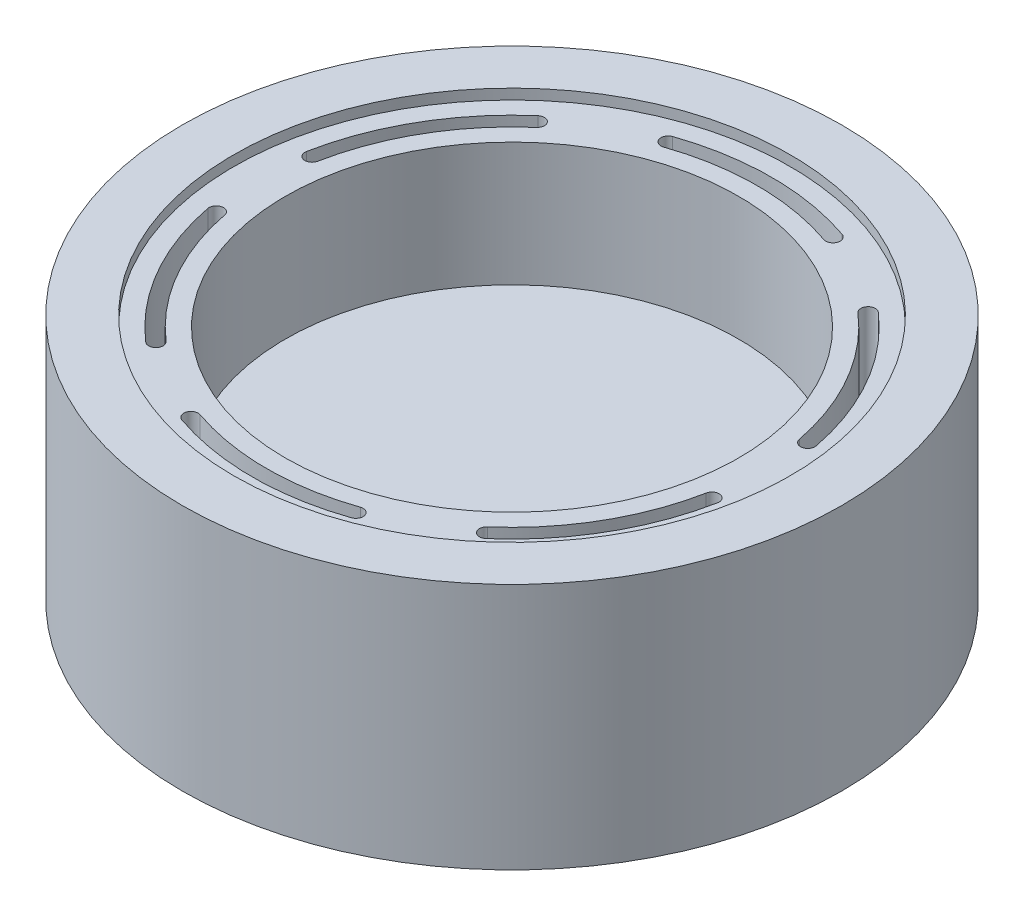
ISO-10303-21;
HEADER;
FILE_DESCRIPTION(('STEP AP214'),'2;1');
FILE_NAME('part.step','',(''),(''),'','','');
FILE_SCHEMA(('AUTOMOTIVE_DESIGN { 1 0 10303 214 1 1 1 1 }'));
ENDSEC;
DATA;
#1=APPLICATION_CONTEXT('core data for automotive mechanical design processes');
#2=APPLICATION_PROTOCOL_DEFINITION('international standard','automotive_design',2000,#1);
#3=PRODUCT_CONTEXT('',#1,'mechanical');
#4=PRODUCT('Part','Part','',(#3));
#5=PRODUCT_RELATED_PRODUCT_CATEGORY('part','',(#4));
#6=PRODUCT_DEFINITION_FORMATION('','',#4);
#7=PRODUCT_DEFINITION_CONTEXT('part definition',#1,'design');
#8=PRODUCT_DEFINITION('design','',#6,#7);
#9=PRODUCT_DEFINITION_SHAPE('','',#8);
#10=(LENGTH_UNIT() NAMED_UNIT(*) SI_UNIT(.MILLI.,.METRE.));
#11=(NAMED_UNIT(*) PLANE_ANGLE_UNIT() SI_UNIT($,.RADIAN.));
#12=(NAMED_UNIT(*) SI_UNIT($,.STERADIAN.) SOLID_ANGLE_UNIT());
#13=UNCERTAINTY_MEASURE_WITH_UNIT(LENGTH_MEASURE(1.E-05),#10,'distance_accuracy_value','');
#14=(GEOMETRIC_REPRESENTATION_CONTEXT(3) GLOBAL_UNCERTAINTY_ASSIGNED_CONTEXT((#13)) GLOBAL_UNIT_ASSIGNED_CONTEXT((#10,
#11,#12)) REPRESENTATION_CONTEXT('',''));
#15=CARTESIAN_POINT('',(0.,0.,0.));
#16=DIRECTION('',(0.,0.,1.));
#17=DIRECTION('',(1.,0.,0.));
#18=AXIS2_PLACEMENT_3D('',#15,#16,#17);
#19=CARTESIAN_POINT('',(335.662294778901,-12.,0.));
#20=DIRECTION('',(0.,1.,0.));
#21=DIRECTION('',(0.,0.,1.));
#22=AXIS2_PLACEMENT_3D('',#19,#20,#21);
#23=PLANE('',#22);
#24=CARTESIAN_POINT('',(347.689601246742,-12.,-2.32516647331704));
#25=DIRECTION('',(0.,1.,0.));
#26=DIRECTION('',(0.,0.,1.));
#27=AXIS2_PLACEMENT_3D('',#24,#25,#26);
#28=CIRCLE('',#27,0.350000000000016);
#29=CARTESIAN_POINT('',(347.345963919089,-12.,-2.25873314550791));
#30=VERTEX_POINT('',#29);
#31=CARTESIAN_POINT('',(348.033238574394,-12.,-2.39159980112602));
#32=VERTEX_POINT('',#31);
#33=EDGE_CURVE('E30',#30,#32,#28,.T.);
#34=ORIENTED_EDGE('',*,*,#33,.F.);
#35=CARTESIAN_POINT('',(335.662294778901,-12.,0.));
#36=DIRECTION('',(0.,-1.,0.));
#37=DIRECTION('',(0.,0.,1.));
#38=AXIS2_PLACEMENT_3D('',#35,#36,#37);
#39=CIRCLE('',#38,11.9);
#40=CARTESIAN_POINT('',(343.460249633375,-12.,-8.9889877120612));
#41=VERTEX_POINT('',#40);
#42=EDGE_CURVE('E193',#41,#30,#39,.T.);
#43=ORIENTED_EDGE('',*,*,#42,.F.);
#44=CARTESIAN_POINT('',(343.689601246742,-12.,-9.25336970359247));
#45=DIRECTION('',(0.,1.,0.));
#46=DIRECTION('',(0.,0.,1.));
#47=AXIS2_PLACEMENT_3D('',#44,#45,#46);
#48=CIRCLE('',#47,0.35000000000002);
#49=CARTESIAN_POINT('',(343.918952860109,-12.,-9.51775169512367));
#50=VERTEX_POINT('',#49);
#51=EDGE_CURVE('E178',#50,#41,#48,.T.);
#52=ORIENTED_EDGE('',*,*,#51,.F.);
#53=CARTESIAN_POINT('',(335.662294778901,-12.,0.));
#54=DIRECTION('',(0.,1.,0.));
#55=DIRECTION('',(0.,0.,1.));
#56=AXIS2_PLACEMENT_3D('',#53,#54,#55);
#57=CIRCLE('',#56,12.6);
#58=EDGE_CURVE('E187',#32,#50,#57,.T.);
#59=ORIENTED_EDGE('',*,*,#58,.F.);
#60=EDGE_LOOP('',(#34,#43,#52,#59));
#61=FACE_BOUND('',#60,.T.);
#62=CARTESIAN_POINT('',(343.689601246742,-12.,9.25336970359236));
#63=DIRECTION('',(0.,1.,0.));
#64=DIRECTION('',(0.,0.,1.));
#65=AXIS2_PLACEMENT_3D('',#62,#63,#64);
#66=CIRCLE('',#65,0.350000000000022);
#67=CARTESIAN_POINT('',(343.460249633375,-12.,8.98898771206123));
#68=VERTEX_POINT('',#67);
#69=CARTESIAN_POINT('',(343.918952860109,-12.,9.51775169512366));
#70=VERTEX_POINT('',#69);
#71=EDGE_CURVE('E200',#68,#70,#66,.T.);
#72=ORIENTED_EDGE('',*,*,#71,.F.);
#73=CARTESIAN_POINT('',(335.662294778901,-12.,0.));
#74=DIRECTION('',(0.,-1.,0.));
#75=DIRECTION('',(0.,0.,1.));
#76=AXIS2_PLACEMENT_3D('',#73,#74,#75);
#77=CIRCLE('',#76,11.9);
#78=CARTESIAN_POINT('',(347.345963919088,-12.,2.25873314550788));
#79=VERTEX_POINT('',#78);
#80=EDGE_CURVE('E210',#79,#68,#77,.T.);
#81=ORIENTED_EDGE('',*,*,#80,.F.);
#82=CARTESIAN_POINT('',(347.689601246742,-12.,2.32516647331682));
#83=DIRECTION('',(0.,1.,0.));
#84=DIRECTION('',(0.,0.,1.));
#85=AXIS2_PLACEMENT_3D('',#82,#83,#84);
#86=CIRCLE('',#85,0.350000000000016);
#87=CARTESIAN_POINT('',(348.033238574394,-12.,2.39159980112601));
#88=VERTEX_POINT('',#87);
#89=EDGE_CURVE('E207',#88,#79,#86,.T.);
#90=ORIENTED_EDGE('',*,*,#89,.F.);
#91=CARTESIAN_POINT('',(335.662294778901,-12.,0.));
#92=DIRECTION('',(0.,1.,0.));
#93=DIRECTION('',(0.,0.,1.));
#94=AXIS2_PLACEMENT_3D('',#91,#92,#93);
#95=CIRCLE('',#94,12.6);
#96=EDGE_CURVE('E204',#70,#88,#95,.T.);
#97=ORIENTED_EDGE('',*,*,#96,.F.);
#98=EDGE_LOOP('',(#72,#81,#90,#97));
#99=FACE_BOUND('',#98,.T.);
#100=CARTESIAN_POINT('',(331.662294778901,-12.,11.5785361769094));
#101=DIRECTION('',(0.,1.,0.));
#102=DIRECTION('',(0.,0.,1.));
#103=AXIS2_PLACEMENT_3D('',#100,#101,#102);
#104=CIRCLE('',#103,0.349999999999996);
#105=CARTESIAN_POINT('',(331.776580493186,-12.,11.2477208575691));
#106=VERTEX_POINT('',#105);
#107=CARTESIAN_POINT('',(331.548009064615,-12.,11.9093514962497));
#108=VERTEX_POINT('',#107);
#109=EDGE_CURVE('E216',#106,#108,#104,.T.);
#110=ORIENTED_EDGE('',*,*,#109,.F.);
#111=CARTESIAN_POINT('',(335.662294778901,-12.,0.));
#112=DIRECTION('',(0.,-1.,0.));
#113=DIRECTION('',(0.,0.,1.));
#114=AXIS2_PLACEMENT_3D('',#111,#112,#113);
#115=CIRCLE('',#114,11.9);
#116=CARTESIAN_POINT('',(339.548009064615,-12.,11.2477208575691));
#117=VERTEX_POINT('',#116);
#118=EDGE_CURVE('E230',#117,#106,#115,.T.);
#119=ORIENTED_EDGE('',*,*,#118,.F.);
#120=CARTESIAN_POINT('',(339.662294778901,-12.,11.5785361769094));
#121=DIRECTION('',(0.,1.,0.));
#122=DIRECTION('',(0.,0.,1.));
#123=AXIS2_PLACEMENT_3D('',#120,#121,#122);
#124=CIRCLE('',#123,0.349999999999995);
#125=CARTESIAN_POINT('',(339.776580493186,-12.,11.9093514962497));
#126=VERTEX_POINT('',#125);
#127=EDGE_CURVE('E227',#126,#117,#124,.T.);
#128=ORIENTED_EDGE('',*,*,#127,.F.);
#129=CARTESIAN_POINT('',(335.662294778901,-12.,0.));
#130=DIRECTION('',(0.,1.,0.));
#131=DIRECTION('',(0.,0.,1.));
#132=AXIS2_PLACEMENT_3D('',#129,#130,#131);
#133=CIRCLE('',#132,12.6);
#134=EDGE_CURVE('E224',#108,#126,#133,.T.);
#135=ORIENTED_EDGE('',*,*,#134,.F.);
#136=EDGE_LOOP('',(#110,#119,#128,#135));
#137=FACE_BOUND('',#136,.T.);
#138=CARTESIAN_POINT('',(323.63498831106,-12.,2.32516647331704));
#139=DIRECTION('',(0.,1.,0.));
#140=DIRECTION('',(0.,0.,1.));
#141=AXIS2_PLACEMENT_3D('',#138,#139,#140);
#142=CIRCLE('',#141,0.350000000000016);
#143=CARTESIAN_POINT('',(323.978625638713,-12.,2.2587331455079));
#144=VERTEX_POINT('',#143);
#145=CARTESIAN_POINT('',(323.291350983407,-12.,2.391599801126));
#146=VERTEX_POINT('',#145);
#147=EDGE_CURVE('E236',#144,#146,#142,.T.);
#148=ORIENTED_EDGE('',*,*,#147,.F.);
#149=CARTESIAN_POINT('',(335.662294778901,-12.,0.));
#150=DIRECTION('',(0.,-1.,0.));
#151=DIRECTION('',(0.,0.,1.));
#152=AXIS2_PLACEMENT_3D('',#149,#150,#151);
#153=CIRCLE('',#152,11.9);
#154=CARTESIAN_POINT('',(327.864339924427,-12.,8.98898771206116));
#155=VERTEX_POINT('',#154);
#156=EDGE_CURVE('E250',#155,#144,#153,.T.);
#157=ORIENTED_EDGE('',*,*,#156,.F.);
#158=CARTESIAN_POINT('',(327.63498831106,-12.,9.25336970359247));
#159=DIRECTION('',(0.,1.,0.));
#160=DIRECTION('',(0.,0.,1.));
#161=AXIS2_PLACEMENT_3D('',#158,#159,#160);
#162=CIRCLE('',#161,0.349999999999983);
#163=CARTESIAN_POINT('',(327.405636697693,-12.,9.51775169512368));
#164=VERTEX_POINT('',#163);
#165=EDGE_CURVE('E247',#164,#155,#162,.T.);
#166=ORIENTED_EDGE('',*,*,#165,.F.);
#167=CARTESIAN_POINT('',(335.662294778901,-12.,0.));
#168=DIRECTION('',(0.,1.,0.));
#169=DIRECTION('',(0.,0.,1.));
#170=AXIS2_PLACEMENT_3D('',#167,#168,#169);
#171=CIRCLE('',#170,12.6);
#172=EDGE_CURVE('E244',#146,#164,#171,.T.);
#173=ORIENTED_EDGE('',*,*,#172,.F.);
#174=EDGE_LOOP('',(#148,#157,#166,#173));
#175=FACE_BOUND('',#174,.T.);
#176=CARTESIAN_POINT('',(327.63498831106,-12.,-9.25336970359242));
#177=DIRECTION('',(0.,1.,0.));
#178=DIRECTION('',(0.,0.,1.));
#179=AXIS2_PLACEMENT_3D('',#176,#177,#178);
#180=CIRCLE('',#179,0.350000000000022);
#181=CARTESIAN_POINT('',(327.864339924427,-12.,-8.98898771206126));
#182=VERTEX_POINT('',#181);
#183=CARTESIAN_POINT('',(327.405636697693,-12.,-9.51775169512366));
#184=VERTEX_POINT('',#183);
#185=EDGE_CURVE('E256',#182,#184,#180,.T.);
#186=ORIENTED_EDGE('',*,*,#185,.F.);
#187=CARTESIAN_POINT('',(335.662294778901,-12.,0.));
#188=DIRECTION('',(0.,-1.,0.));
#189=DIRECTION('',(0.,0.,1.));
#190=AXIS2_PLACEMENT_3D('',#187,#188,#189);
#191=CIRCLE('',#190,11.9);
#192=CARTESIAN_POINT('',(323.978625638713,-12.,-2.25873314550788));
#193=VERTEX_POINT('',#192);
#194=EDGE_CURVE('E270',#193,#182,#191,.T.);
#195=ORIENTED_EDGE('',*,*,#194,.F.);
#196=CARTESIAN_POINT('',(323.63498831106,-12.,-2.32516647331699));
#197=DIRECTION('',(0.,1.,0.));
#198=DIRECTION('',(0.,0.,1.));
#199=AXIS2_PLACEMENT_3D('',#196,#197,#198);
#200=CIRCLE('',#199,0.349999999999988);
#201=CARTESIAN_POINT('',(323.291350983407,-12.,-2.39159980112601));
#202=VERTEX_POINT('',#201);
#203=EDGE_CURVE('E267',#202,#193,#200,.T.);
#204=ORIENTED_EDGE('',*,*,#203,.F.);
#205=CARTESIAN_POINT('',(335.662294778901,-12.,0.));
#206=DIRECTION('',(0.,1.,0.));
#207=DIRECTION('',(0.,0.,1.));
#208=AXIS2_PLACEMENT_3D('',#205,#206,#207);
#209=CIRCLE('',#208,12.6);
#210=EDGE_CURVE('E264',#184,#202,#209,.T.);
#211=ORIENTED_EDGE('',*,*,#210,.F.);
#212=EDGE_LOOP('',(#186,#195,#204,#211));
#213=FACE_BOUND('',#212,.T.);
#214=CARTESIAN_POINT('',(339.662294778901,-12.,-11.5785361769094));
#215=DIRECTION('',(0.,1.,0.));
#216=DIRECTION('',(0.,0.,1.));
#217=AXIS2_PLACEMENT_3D('',#214,#215,#216);
#218=CIRCLE('',#217,0.349999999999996);
#219=CARTESIAN_POINT('',(339.548009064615,-12.,-11.2477208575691));
#220=VERTEX_POINT('',#219);
#221=CARTESIAN_POINT('',(339.776580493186,-12.,-11.9093514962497));
#222=VERTEX_POINT('',#221);
#223=EDGE_CURVE('E276',#220,#222,#218,.T.);
#224=ORIENTED_EDGE('',*,*,#223,.F.);
#225=CARTESIAN_POINT('',(335.662294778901,-12.,0.));
#226=DIRECTION('',(0.,-1.,0.));
#227=DIRECTION('',(0.,0.,1.));
#228=AXIS2_PLACEMENT_3D('',#225,#226,#227);
#229=CIRCLE('',#228,11.9);
#230=CARTESIAN_POINT('',(331.776580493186,-12.,-11.2477208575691));
#231=VERTEX_POINT('',#230);
#232=EDGE_CURVE('E290',#231,#220,#229,.T.);
#233=ORIENTED_EDGE('',*,*,#232,.F.);
#234=CARTESIAN_POINT('',(331.662294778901,-12.,-11.5785361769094));
#235=DIRECTION('',(0.,1.,0.));
#236=DIRECTION('',(0.,0.,1.));
#237=AXIS2_PLACEMENT_3D('',#234,#235,#236);
#238=CIRCLE('',#237,0.349999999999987);
#239=CARTESIAN_POINT('',(331.548009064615,-12.,-11.9093514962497));
#240=VERTEX_POINT('',#239);
#241=EDGE_CURVE('E287',#240,#231,#238,.T.);
#242=ORIENTED_EDGE('',*,*,#241,.F.);
#243=CARTESIAN_POINT('',(335.662294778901,-12.,0.));
#244=DIRECTION('',(0.,1.,0.));
#245=DIRECTION('',(0.,0.,1.));
#246=AXIS2_PLACEMENT_3D('',#243,#244,#245);
#247=CIRCLE('',#246,12.6);
#248=EDGE_CURVE('E284',#222,#240,#247,.T.);
#249=ORIENTED_EDGE('',*,*,#248,.F.);
#250=EDGE_LOOP('',(#224,#233,#242,#249));
#251=FACE_BOUND('',#250,.T.);
#252=CARTESIAN_POINT('',(335.662294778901,-12.,0.));
#253=DIRECTION('',(0.,1.,0.));
#254=DIRECTION('',(0.,0.,1.));
#255=AXIS2_PLACEMENT_3D('',#252,#253,#254);
#256=CIRCLE('',#255,11.);
#257=CARTESIAN_POINT('',(335.662294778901,-12.,11.));
#258=VERTEX_POINT('',#257);
#259=EDGE_CURVE('E306',#258,#258,#256,.T.);
#260=ORIENTED_EDGE('',*,*,#259,.F.);
#261=EDGE_LOOP('',(#260));
#262=FACE_BOUND('',#261,.T.);
#263=CARTESIAN_POINT('',(335.662294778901,-12.,0.));
#264=DIRECTION('',(0.,1.,0.));
#265=DIRECTION('',(0.,0.,1.));
#266=AXIS2_PLACEMENT_3D('',#263,#264,#265);
#267=CIRCLE('',#266,13.5);
#268=CARTESIAN_POINT('',(335.662294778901,-12.,13.5));
#269=VERTEX_POINT('',#268);
#270=EDGE_CURVE('E312',#269,#269,#267,.T.);
#271=ORIENTED_EDGE('',*,*,#270,.T.);
#272=EDGE_LOOP('',(#271));
#273=FACE_BOUND('',#272,.T.);
#274=ADVANCED_FACE('F16',(#61,#99,#137,#175,#213,#251,#262,#273),#23,.T.);
#275=CARTESIAN_POINT('',(319.662294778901,-23.5,0.));
#276=DIRECTION('',(0.,-1.,0.));
#277=DIRECTION('',(0.,0.,-1.));
#278=AXIS2_PLACEMENT_3D('',#275,#276,#277);
#279=PLANE('',#278);
#280=CARTESIAN_POINT('',(335.662294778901,-23.5,0.));
#281=DIRECTION('',(0.,-1.,0.));
#282=DIRECTION('',(0.,0.,-1.));
#283=AXIS2_PLACEMENT_3D('',#280,#281,#282);
#284=CIRCLE('',#283,14.5);
#285=CARTESIAN_POINT('',(335.662294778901,-23.5,-14.5));
#286=VERTEX_POINT('',#285);
#287=EDGE_CURVE('E296',#286,#286,#284,.T.);
#288=ORIENTED_EDGE('',*,*,#287,.F.);
#289=EDGE_LOOP('',(#288));
#290=FACE_BOUND('',#289,.T.);
#291=CARTESIAN_POINT('',(335.662294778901,-23.5,0.));
#292=DIRECTION('',(0.,1.,0.));
#293=DIRECTION('',(0.,0.,1.));
#294=AXIS2_PLACEMENT_3D('',#291,#292,#293);
#295=CIRCLE('',#294,16.);
#296=CARTESIAN_POINT('',(335.662294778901,-23.5,16.));
#297=VERTEX_POINT('',#296);
#298=EDGE_CURVE('E323',#297,#297,#295,.T.);
#299=ORIENTED_EDGE('',*,*,#298,.F.);
#300=EDGE_LOOP('',(#299));
#301=FACE_BOUND('',#300,.T.);
#302=ADVANCED_FACE('F398',(#290,#301),#279,.T.);
#303=CARTESIAN_POINT('',(335.662294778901,-12.,0.));
#304=DIRECTION('',(0.,1.,0.));
#305=DIRECTION('',(0.,0.,1.));
#306=AXIS2_PLACEMENT_3D('',#303,#304,#305);
#307=CYLINDRICAL_SURFACE('',#306,16.);
#308=ORIENTED_EDGE('',*,*,#298,.T.);
#309=EDGE_LOOP('',(#308));
#310=FACE_BOUND('',#309,.T.);
#311=CARTESIAN_POINT('',(335.662294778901,-11.5,0.));
#312=DIRECTION('',(0.,1.,0.));
#313=DIRECTION('',(0.,0.,1.));
#314=AXIS2_PLACEMENT_3D('',#311,#312,#313);
#315=CIRCLE('',#314,16.);
#316=CARTESIAN_POINT('',(335.662294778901,-11.5,16.));
#317=VERTEX_POINT('',#316);
#318=EDGE_CURVE('E320',#317,#317,#315,.T.);
#319=ORIENTED_EDGE('',*,*,#318,.F.);
#320=EDGE_LOOP('',(#319));
#321=FACE_BOUND('',#320,.T.);
#322=ADVANCED_FACE('F403',(#310,#321),#307,.T.);
#323=CARTESIAN_POINT('',(322.162294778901,-11.5,0.));
#324=DIRECTION('',(0.,1.,0.));
#325=DIRECTION('',(0.,0.,1.));
#326=AXIS2_PLACEMENT_3D('',#323,#324,#325);
#327=PLANE('',#326);
#328=ORIENTED_EDGE('',*,*,#318,.T.);
#329=EDGE_LOOP('',(#328));
#330=FACE_BOUND('',#329,.T.);
#331=CARTESIAN_POINT('',(335.662294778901,-11.5,0.));
#332=DIRECTION('',(0.,1.,0.));
#333=DIRECTION('',(0.,0.,1.));
#334=AXIS2_PLACEMENT_3D('',#331,#332,#333);
#335=CIRCLE('',#334,13.5);
#336=CARTESIAN_POINT('',(335.662294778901,-11.5,13.5));
#337=VERTEX_POINT('',#336);
#338=EDGE_CURVE('E317',#337,#337,#335,.T.);
#339=ORIENTED_EDGE('',*,*,#338,.F.);
#340=EDGE_LOOP('',(#339));
#341=FACE_BOUND('',#340,.T.);
#342=ADVANCED_FACE('F409',(#330,#341),#327,.T.);
#343=CARTESIAN_POINT('',(335.662294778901,-12.,0.));
#344=DIRECTION('',(0.,1.,0.));
#345=DIRECTION('',(0.,0.,1.));
#346=AXIS2_PLACEMENT_3D('',#343,#344,#345);
#347=CYLINDRICAL_SURFACE('',#346,13.5);
#348=ORIENTED_EDGE('',*,*,#338,.T.);
#349=EDGE_LOOP('',(#348));
#350=FACE_BOUND('',#349,.T.);
#351=ORIENTED_EDGE('',*,*,#270,.F.);
#352=EDGE_LOOP('',(#351));
#353=FACE_BOUND('',#352,.T.);
#354=ADVANCED_FACE('F417',(#350,#353),#347,.F.);
#355=CARTESIAN_POINT('',(335.662294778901,-18.,0.));
#356=DIRECTION('',(0.,1.,0.));
#357=DIRECTION('',(0.,0.,1.));
#358=AXIS2_PLACEMENT_3D('',#355,#356,#357);
#359=CYLINDRICAL_SURFACE('',#358,11.);
#360=CARTESIAN_POINT('',(335.662294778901,-18.,0.));
#361=DIRECTION('',(0.,1.,0.));
#362=DIRECTION('',(0.,0.,1.));
#363=AXIS2_PLACEMENT_3D('',#360,#361,#362);
#364=CIRCLE('',#363,11.);
#365=CARTESIAN_POINT('',(335.662294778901,-18.,11.));
#366=VERTEX_POINT('',#365);
#367=EDGE_CURVE('E309',#366,#366,#364,.T.);
#368=ORIENTED_EDGE('',*,*,#367,.F.);
#369=EDGE_LOOP('',(#368));
#370=FACE_BOUND('',#369,.T.);
#371=ORIENTED_EDGE('',*,*,#259,.T.);
#372=EDGE_LOOP('',(#371));
#373=FACE_BOUND('',#372,.T.);
#374=ADVANCED_FACE('F421',(#370,#373),#359,.F.);
#375=CARTESIAN_POINT('',(335.662294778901,-18.,0.));
#376=DIRECTION('',(0.,1.,0.));
#377=DIRECTION('',(0.,0.,1.));
#378=AXIS2_PLACEMENT_3D('',#375,#376,#377);
#379=PLANE('',#378);
#380=ORIENTED_EDGE('',*,*,#367,.T.);
#381=EDGE_LOOP('',(#380));
#382=FACE_BOUND('',#381,.T.);
#383=ADVANCED_FACE('F425',(#382),#379,.T.);
#384=CARTESIAN_POINT('',(335.662294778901,-22.5,0.));
#385=DIRECTION('',(0.,-1.,0.));
#386=DIRECTION('',(0.,0.,-1.));
#387=AXIS2_PLACEMENT_3D('',#384,#385,#386);
#388=CYLINDRICAL_SURFACE('',#387,14.5);
#389=CARTESIAN_POINT('',(335.662294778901,-22.5,0.));
#390=DIRECTION('',(0.,-1.,0.));
#391=DIRECTION('',(0.,0.,-1.));
#392=AXIS2_PLACEMENT_3D('',#389,#390,#391);
#393=CIRCLE('',#392,14.5);
#394=CARTESIAN_POINT('',(335.662294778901,-22.5,-14.5));
#395=VERTEX_POINT('',#394);
#396=EDGE_CURVE('E303',#395,#395,#393,.T.);
#397=ORIENTED_EDGE('',*,*,#396,.F.);
#398=EDGE_LOOP('',(#397));
#399=FACE_BOUND('',#398,.T.);
#400=ORIENTED_EDGE('',*,*,#287,.T.);
#401=EDGE_LOOP('',(#400));
#402=FACE_BOUND('',#401,.T.);
#403=ADVANCED_FACE('F429',(#399,#402),#388,.F.);
#404=CARTESIAN_POINT('',(335.662294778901,-22.5,0.));
#405=DIRECTION('',(0.,-1.,0.));
#406=DIRECTION('',(0.,0.,-1.));
#407=AXIS2_PLACEMENT_3D('',#404,#405,#406);
#408=PLANE('',#407);
#409=CARTESIAN_POINT('',(347.689601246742,-22.5,-2.32516647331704));
#410=DIRECTION('',(0.,-1.,0.));
#411=DIRECTION('',(0.,0.,-1.));
#412=AXIS2_PLACEMENT_3D('',#409,#410,#411);
#413=CIRCLE('',#412,0.350000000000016);
#414=CARTESIAN_POINT('',(348.033238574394,-22.5,-2.39159980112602));
#415=VERTEX_POINT('',#414);
#416=CARTESIAN_POINT('',(347.345963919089,-22.5,-2.25873314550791));
#417=VERTEX_POINT('',#416);
#418=EDGE_CURVE('E11',#415,#417,#413,.T.);
#419=ORIENTED_EDGE('',*,*,#418,.F.);
#420=CARTESIAN_POINT('',(335.662294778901,-22.5,0.));
#421=DIRECTION('',(0.,-1.,0.));
#422=DIRECTION('',(0.,0.,-1.));
#423=AXIS2_PLACEMENT_3D('',#420,#421,#422);
#424=CIRCLE('',#423,12.6);
#425=CARTESIAN_POINT('',(343.918952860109,-22.5,-9.51775169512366));
#426=VERTEX_POINT('',#425);
#427=EDGE_CURVE('E371',#426,#415,#424,.T.);
#428=ORIENTED_EDGE('',*,*,#427,.F.);
#429=CARTESIAN_POINT('',(343.689601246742,-22.5,-9.25336970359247));
#430=DIRECTION('',(0.,-1.,0.));
#431=DIRECTION('',(0.,0.,-1.));
#432=AXIS2_PLACEMENT_3D('',#429,#430,#431);
#433=CIRCLE('',#432,0.35000000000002);
#434=CARTESIAN_POINT('',(343.460249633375,-22.5,-8.9889877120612));
#435=VERTEX_POINT('',#434);
#436=EDGE_CURVE('E181',#435,#426,#433,.T.);
#437=ORIENTED_EDGE('',*,*,#436,.F.);
#438=CARTESIAN_POINT('',(335.662294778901,-22.5,0.));
#439=DIRECTION('',(0.,-1.,0.));
#440=DIRECTION('',(0.,0.,-1.));
#441=AXIS2_PLACEMENT_3D('',#438,#439,#440);
#442=CIRCLE('',#441,11.9);
#443=EDGE_CURVE('E23',#417,#435,#442,.F.);
#444=ORIENTED_EDGE('',*,*,#443,.F.);
#445=EDGE_LOOP('',(#419,#428,#437,#444));
#446=FACE_BOUND('',#445,.T.);
#447=CARTESIAN_POINT('',(343.689601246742,-22.5,9.25336970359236));
#448=DIRECTION('',(0.,-1.,0.));
#449=DIRECTION('',(0.,0.,-1.));
#450=AXIS2_PLACEMENT_3D('',#447,#448,#449);
#451=CIRCLE('',#450,0.350000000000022);
#452=CARTESIAN_POINT('',(343.918952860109,-22.5,9.51775169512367));
#453=VERTEX_POINT('',#452);
#454=CARTESIAN_POINT('',(343.460249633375,-22.5,8.98898771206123));
#455=VERTEX_POINT('',#454);
#456=EDGE_CURVE('E369',#453,#455,#451,.T.);
#457=ORIENTED_EDGE('',*,*,#456,.F.);
#458=CARTESIAN_POINT('',(335.662294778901,-22.5,0.));
#459=DIRECTION('',(0.,-1.,0.));
#460=DIRECTION('',(0.,0.,-1.));
#461=AXIS2_PLACEMENT_3D('',#458,#459,#460);
#462=CIRCLE('',#461,12.6);
#463=CARTESIAN_POINT('',(348.033238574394,-22.5,2.39159980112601));
#464=VERTEX_POINT('',#463);
#465=EDGE_CURVE('E362',#464,#453,#462,.T.);
#466=ORIENTED_EDGE('',*,*,#465,.F.);
#467=CARTESIAN_POINT('',(347.689601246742,-22.5,2.32516647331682));
#468=DIRECTION('',(0.,-1.,0.));
#469=DIRECTION('',(0.,0.,-1.));
#470=AXIS2_PLACEMENT_3D('',#467,#468,#469);
#471=CIRCLE('',#470,0.350000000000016);
#472=CARTESIAN_POINT('',(347.345963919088,-22.5,2.25873314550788));
#473=VERTEX_POINT('',#472);
#474=EDGE_CURVE('E364',#473,#464,#471,.T.);
#475=ORIENTED_EDGE('',*,*,#474,.F.);
#476=CARTESIAN_POINT('',(335.662294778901,-22.5,0.));
#477=DIRECTION('',(0.,-1.,0.));
#478=DIRECTION('',(0.,0.,-1.));
#479=AXIS2_PLACEMENT_3D('',#476,#477,#478);
#480=CIRCLE('',#479,11.9);
#481=EDGE_CURVE('E367',#455,#473,#480,.F.);
#482=ORIENTED_EDGE('',*,*,#481,.F.);
#483=EDGE_LOOP('',(#457,#466,#475,#482));
#484=FACE_BOUND('',#483,.T.);
#485=CARTESIAN_POINT('',(331.662294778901,-22.5,11.5785361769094));
#486=DIRECTION('',(0.,-1.,0.));
#487=DIRECTION('',(0.,0.,-1.));
#488=AXIS2_PLACEMENT_3D('',#485,#486,#487);
#489=CIRCLE('',#488,0.349999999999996);
#490=CARTESIAN_POINT('',(331.548009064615,-22.5,11.9093514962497));
#491=VERTEX_POINT('',#490);
#492=CARTESIAN_POINT('',(331.776580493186,-22.5,11.2477208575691));
#493=VERTEX_POINT('',#492);
#494=EDGE_CURVE('E360',#491,#493,#489,.T.);
#495=ORIENTED_EDGE('',*,*,#494,.F.);
#496=CARTESIAN_POINT('',(335.662294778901,-22.5,0.));
#497=DIRECTION('',(0.,-1.,0.));
#498=DIRECTION('',(0.,0.,-1.));
#499=AXIS2_PLACEMENT_3D('',#496,#497,#498);
#500=CIRCLE('',#499,12.6);
#501=CARTESIAN_POINT('',(339.776580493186,-22.5,11.9093514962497));
#502=VERTEX_POINT('',#501);
#503=EDGE_CURVE('E353',#502,#491,#500,.T.);
#504=ORIENTED_EDGE('',*,*,#503,.F.);
#505=CARTESIAN_POINT('',(339.662294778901,-22.5,11.5785361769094));
#506=DIRECTION('',(0.,-1.,0.));
#507=DIRECTION('',(0.,0.,-1.));
#508=AXIS2_PLACEMENT_3D('',#505,#506,#507);
#509=CIRCLE('',#508,0.349999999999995);
#510=CARTESIAN_POINT('',(339.548009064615,-22.5,11.2477208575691));
#511=VERTEX_POINT('',#510);
#512=EDGE_CURVE('E355',#511,#502,#509,.T.);
#513=ORIENTED_EDGE('',*,*,#512,.F.);
#514=CARTESIAN_POINT('',(335.662294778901,-22.5,0.));
#515=DIRECTION('',(0.,-1.,0.));
#516=DIRECTION('',(0.,0.,-1.));
#517=AXIS2_PLACEMENT_3D('',#514,#515,#516);
#518=CIRCLE('',#517,11.9);
#519=EDGE_CURVE('E358',#493,#511,#518,.F.);
#520=ORIENTED_EDGE('',*,*,#519,.F.);
#521=EDGE_LOOP('',(#495,#504,#513,#520));
#522=FACE_BOUND('',#521,.T.);
#523=CARTESIAN_POINT('',(323.63498831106,-22.5,2.32516647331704));
#524=DIRECTION('',(0.,-1.,0.));
#525=DIRECTION('',(0.,0.,-1.));
#526=AXIS2_PLACEMENT_3D('',#523,#524,#525);
#527=CIRCLE('',#526,0.350000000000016);
#528=CARTESIAN_POINT('',(323.291350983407,-22.5,2.391599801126));
#529=VERTEX_POINT('',#528);
#530=CARTESIAN_POINT('',(323.978625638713,-22.5,2.2587331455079));
#531=VERTEX_POINT('',#530);
#532=EDGE_CURVE('E351',#529,#531,#527,.T.);
#533=ORIENTED_EDGE('',*,*,#532,.F.);
#534=CARTESIAN_POINT('',(335.662294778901,-22.5,0.));
#535=DIRECTION('',(0.,-1.,0.));
#536=DIRECTION('',(0.,0.,-1.));
#537=AXIS2_PLACEMENT_3D('',#534,#535,#536);
#538=CIRCLE('',#537,12.6);
#539=CARTESIAN_POINT('',(327.405636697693,-22.5,9.51775169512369));
#540=VERTEX_POINT('',#539);
#541=EDGE_CURVE('E344',#540,#529,#538,.T.);
#542=ORIENTED_EDGE('',*,*,#541,.F.);
#543=CARTESIAN_POINT('',(327.63498831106,-22.5,9.25336970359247));
#544=DIRECTION('',(0.,-1.,0.));
#545=DIRECTION('',(0.,0.,-1.));
#546=AXIS2_PLACEMENT_3D('',#543,#544,#545);
#547=CIRCLE('',#546,0.349999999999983);
#548=CARTESIAN_POINT('',(327.864339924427,-22.5,8.98898771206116));
#549=VERTEX_POINT('',#548);
#550=EDGE_CURVE('E346',#549,#540,#547,.T.);
#551=ORIENTED_EDGE('',*,*,#550,.F.);
#552=CARTESIAN_POINT('',(335.662294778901,-22.5,0.));
#553=DIRECTION('',(0.,-1.,0.));
#554=DIRECTION('',(0.,0.,-1.));
#555=AXIS2_PLACEMENT_3D('',#552,#553,#554);
#556=CIRCLE('',#555,11.9);
#557=EDGE_CURVE('E349',#531,#549,#556,.F.);
#558=ORIENTED_EDGE('',*,*,#557,.F.);
#559=EDGE_LOOP('',(#533,#542,#551,#558));
#560=FACE_BOUND('',#559,.T.);
#561=CARTESIAN_POINT('',(327.63498831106,-22.5,-9.25336970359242));
#562=DIRECTION('',(0.,-1.,0.));
#563=DIRECTION('',(0.,0.,-1.));
#564=AXIS2_PLACEMENT_3D('',#561,#562,#563);
#565=CIRCLE('',#564,0.350000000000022);
#566=CARTESIAN_POINT('',(327.405636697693,-22.5,-9.51775169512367));
#567=VERTEX_POINT('',#566);
#568=CARTESIAN_POINT('',(327.864339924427,-22.5,-8.98898771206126));
#569=VERTEX_POINT('',#568);
#570=EDGE_CURVE('E342',#567,#569,#565,.T.);
#571=ORIENTED_EDGE('',*,*,#570,.F.);
#572=CARTESIAN_POINT('',(335.662294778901,-22.5,0.));
#573=DIRECTION('',(0.,-1.,0.));
#574=DIRECTION('',(0.,0.,-1.));
#575=AXIS2_PLACEMENT_3D('',#572,#573,#574);
#576=CIRCLE('',#575,12.6);
#577=CARTESIAN_POINT('',(323.291350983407,-22.5,-2.39159980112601));
#578=VERTEX_POINT('',#577);
#579=EDGE_CURVE('E335',#578,#567,#576,.T.);
#580=ORIENTED_EDGE('',*,*,#579,.F.);
#581=CARTESIAN_POINT('',(323.63498831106,-22.5,-2.32516647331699));
#582=DIRECTION('',(0.,-1.,0.));
#583=DIRECTION('',(0.,0.,-1.));
#584=AXIS2_PLACEMENT_3D('',#581,#582,#583);
#585=CIRCLE('',#584,0.349999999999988);
#586=CARTESIAN_POINT('',(323.978625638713,-22.5,-2.25873314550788));
#587=VERTEX_POINT('',#586);
#588=EDGE_CURVE('E337',#587,#578,#585,.T.);
#589=ORIENTED_EDGE('',*,*,#588,.F.);
#590=CARTESIAN_POINT('',(335.662294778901,-22.5,0.));
#591=DIRECTION('',(0.,-1.,0.));
#592=DIRECTION('',(0.,0.,-1.));
#593=AXIS2_PLACEMENT_3D('',#590,#591,#592);
#594=CIRCLE('',#593,11.9);
#595=EDGE_CURVE('E340',#569,#587,#594,.F.);
#596=ORIENTED_EDGE('',*,*,#595,.F.);
#597=EDGE_LOOP('',(#571,#580,#589,#596));
#598=FACE_BOUND('',#597,.T.);
#599=CARTESIAN_POINT('',(339.662294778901,-22.5,-11.5785361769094));
#600=DIRECTION('',(0.,-1.,0.));
#601=DIRECTION('',(0.,0.,-1.));
#602=AXIS2_PLACEMENT_3D('',#599,#600,#601);
#603=CIRCLE('',#602,0.349999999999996);
#604=CARTESIAN_POINT('',(339.776580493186,-22.5,-11.9093514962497));
#605=VERTEX_POINT('',#604);
#606=CARTESIAN_POINT('',(339.548009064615,-22.5,-11.2477208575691));
#607=VERTEX_POINT('',#606);
#608=EDGE_CURVE('E333',#605,#607,#603,.T.);
#609=ORIENTED_EDGE('',*,*,#608,.F.);
#610=CARTESIAN_POINT('',(335.662294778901,-22.5,0.));
#611=DIRECTION('',(0.,-1.,0.));
#612=DIRECTION('',(0.,0.,-1.));
#613=AXIS2_PLACEMENT_3D('',#610,#611,#612);
#614=CIRCLE('',#613,12.6);
#615=CARTESIAN_POINT('',(331.548009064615,-22.5,-11.9093514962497));
#616=VERTEX_POINT('',#615);
#617=EDGE_CURVE('E326',#616,#605,#614,.T.);
#618=ORIENTED_EDGE('',*,*,#617,.F.);
#619=CARTESIAN_POINT('',(331.662294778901,-22.5,-11.5785361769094));
#620=DIRECTION('',(0.,-1.,0.));
#621=DIRECTION('',(0.,0.,-1.));
#622=AXIS2_PLACEMENT_3D('',#619,#620,#621);
#623=CIRCLE('',#622,0.349999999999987);
#624=CARTESIAN_POINT('',(331.776580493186,-22.5,-11.2477208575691));
#625=VERTEX_POINT('',#624);
#626=EDGE_CURVE('E328',#625,#616,#623,.T.);
#627=ORIENTED_EDGE('',*,*,#626,.F.);
#628=CARTESIAN_POINT('',(335.662294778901,-22.5,0.));
#629=DIRECTION('',(0.,-1.,0.));
#630=DIRECTION('',(0.,0.,-1.));
#631=AXIS2_PLACEMENT_3D('',#628,#629,#630);
#632=CIRCLE('',#631,11.9);
#633=EDGE_CURVE('E331',#607,#625,#632,.F.);
#634=ORIENTED_EDGE('',*,*,#633,.F.);
#635=EDGE_LOOP('',(#609,#618,#627,#634));
#636=FACE_BOUND('',#635,.T.);
#637=ORIENTED_EDGE('',*,*,#396,.T.);
#638=EDGE_LOOP('',(#637));
#639=FACE_BOUND('',#638,.T.);
#640=ADVANCED_FACE('F379',(#446,#484,#522,#560,#598,#636,#639),#408,.T.);
#641=CARTESIAN_POINT('',(339.662294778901,-23.5,-11.5785361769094));
#642=DIRECTION('',(0.,1.,0.));
#643=DIRECTION('',(0.,0.,1.));
#644=AXIS2_PLACEMENT_3D('',#641,#642,#643);
#645=CYLINDRICAL_SURFACE('',#644,0.349999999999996);
#646=ORIENTED_EDGE('',*,*,#608,.T.);
#647=DIRECTION('',(0.,1.,0.));
#648=VECTOR('',#647,1.);
#649=CARTESIAN_POINT('',(339.548009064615,-23.5,-11.2477208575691));
#650=LINE('',#649,#648);
#651=EDGE_CURVE('E294',#607,#220,#650,.T.);
#652=ORIENTED_EDGE('',*,*,#651,.T.);
#653=ORIENTED_EDGE('',*,*,#223,.T.);
#654=DIRECTION('',(0.,1.,0.));
#655=VECTOR('',#654,1.);
#656=CARTESIAN_POINT('',(339.776580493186,-23.5,-11.9093514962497));
#657=LINE('',#656,#655);
#658=EDGE_CURVE('E293',#605,#222,#657,.T.);
#659=ORIENTED_EDGE('',*,*,#658,.F.);
#660=EDGE_LOOP('',(#646,#652,#653,#659));
#661=FACE_BOUND('',#660,.T.);
#662=ADVANCED_FACE('F436',(#661),#645,.F.);
#663=CARTESIAN_POINT('',(335.662294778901,-23.5,0.));
#664=DIRECTION('',(0.,1.,0.));
#665=DIRECTION('',(0.,0.,1.));
#666=AXIS2_PLACEMENT_3D('',#663,#664,#665);
#667=CYLINDRICAL_SURFACE('',#666,11.9);
#668=ORIENTED_EDGE('',*,*,#633,.T.);
#669=DIRECTION('',(0.,1.,0.));
#670=VECTOR('',#669,1.);
#671=CARTESIAN_POINT('',(331.776580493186,-23.5,-11.2477208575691));
#672=LINE('',#671,#670);
#673=EDGE_CURVE('E297',#625,#231,#672,.T.);
#674=ORIENTED_EDGE('',*,*,#673,.T.);
#675=ORIENTED_EDGE('',*,*,#232,.T.);
#676=ORIENTED_EDGE('',*,*,#651,.F.);
#677=EDGE_LOOP('',(#668,#674,#675,#676));
#678=FACE_BOUND('',#677,.T.);
#679=ADVANCED_FACE('F439',(#678),#667,.T.);
#680=CARTESIAN_POINT('',(331.662294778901,-23.5,-11.5785361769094));
#681=DIRECTION('',(0.,1.,0.));
#682=DIRECTION('',(0.,0.,1.));
#683=AXIS2_PLACEMENT_3D('',#680,#681,#682);
#684=CYLINDRICAL_SURFACE('',#683,0.349999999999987);
#685=ORIENTED_EDGE('',*,*,#626,.T.);
#686=DIRECTION('',(0.,1.,0.));
#687=VECTOR('',#686,1.);
#688=CARTESIAN_POINT('',(331.548009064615,-23.5,-11.9093514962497));
#689=LINE('',#688,#687);
#690=EDGE_CURVE('E299',#616,#240,#689,.T.);
#691=ORIENTED_EDGE('',*,*,#690,.T.);
#692=ORIENTED_EDGE('',*,*,#241,.T.);
#693=ORIENTED_EDGE('',*,*,#673,.F.);
#694=EDGE_LOOP('',(#685,#691,#692,#693));
#695=FACE_BOUND('',#694,.T.);
#696=ADVANCED_FACE('F445',(#695),#684,.F.);
#697=CARTESIAN_POINT('',(335.662294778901,-23.5,0.));
#698=DIRECTION('',(0.,1.,0.));
#699=DIRECTION('',(0.,0.,1.));
#700=AXIS2_PLACEMENT_3D('',#697,#698,#699);
#701=CYLINDRICAL_SURFACE('',#700,12.6);
#702=ORIENTED_EDGE('',*,*,#617,.T.);
#703=ORIENTED_EDGE('',*,*,#658,.T.);
#704=ORIENTED_EDGE('',*,*,#248,.T.);
#705=ORIENTED_EDGE('',*,*,#690,.F.);
#706=EDGE_LOOP('',(#702,#703,#704,#705));
#707=FACE_BOUND('',#706,.T.);
#708=ADVANCED_FACE('F441',(#707),#701,.F.);
#709=CARTESIAN_POINT('',(327.63498831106,-23.5,-9.25336970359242));
#710=DIRECTION('',(0.,1.,0.));
#711=DIRECTION('',(0.,0.,1.));
#712=AXIS2_PLACEMENT_3D('',#709,#710,#711);
#713=CYLINDRICAL_SURFACE('',#712,0.350000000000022);
#714=ORIENTED_EDGE('',*,*,#570,.T.);
#715=DIRECTION('',(0.,1.,0.));
#716=VECTOR('',#715,1.);
#717=CARTESIAN_POINT('',(327.864339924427,-23.5,-8.98898771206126));
#718=LINE('',#717,#716);
#719=EDGE_CURVE('E274',#569,#182,#718,.T.);
#720=ORIENTED_EDGE('',*,*,#719,.T.);
#721=ORIENTED_EDGE('',*,*,#185,.T.);
#722=DIRECTION('',(0.,1.,0.));
#723=VECTOR('',#722,1.);
#724=CARTESIAN_POINT('',(327.405636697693,-23.5,-9.51775169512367));
#725=LINE('',#724,#723);
#726=EDGE_CURVE('E273',#567,#184,#725,.T.);
#727=ORIENTED_EDGE('',*,*,#726,.F.);
#728=EDGE_LOOP('',(#714,#720,#721,#727));
#729=FACE_BOUND('',#728,.T.);
#730=ADVANCED_FACE('F444',(#729),#713,.F.);
#731=CARTESIAN_POINT('',(335.662294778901,-23.5,0.));
#732=DIRECTION('',(0.,1.,0.));
#733=DIRECTION('',(0.,0.,1.));
#734=AXIS2_PLACEMENT_3D('',#731,#732,#733);
#735=CYLINDRICAL_SURFACE('',#734,11.9);
#736=ORIENTED_EDGE('',*,*,#595,.T.);
#737=DIRECTION('',(0.,1.,0.));
#738=VECTOR('',#737,1.);
#739=CARTESIAN_POINT('',(323.978625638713,-23.5,-2.25873314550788));
#740=LINE('',#739,#738);
#741=EDGE_CURVE('E277',#587,#193,#740,.T.);
#742=ORIENTED_EDGE('',*,*,#741,.T.);
#743=ORIENTED_EDGE('',*,*,#194,.T.);
#744=ORIENTED_EDGE('',*,*,#719,.F.);
#745=EDGE_LOOP('',(#736,#742,#743,#744));
#746=FACE_BOUND('',#745,.T.);
#747=ADVANCED_FACE('F455',(#746),#735,.T.);
#748=CARTESIAN_POINT('',(323.63498831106,-23.5,-2.32516647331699));
#749=DIRECTION('',(0.,1.,0.));
#750=DIRECTION('',(0.,0.,1.));
#751=AXIS2_PLACEMENT_3D('',#748,#749,#750);
#752=CYLINDRICAL_SURFACE('',#751,0.349999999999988);
#753=ORIENTED_EDGE('',*,*,#588,.T.);
#754=DIRECTION('',(0.,1.,0.));
#755=VECTOR('',#754,1.);
#756=CARTESIAN_POINT('',(323.291350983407,-23.5,-2.39159980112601));
#757=LINE('',#756,#755);
#758=EDGE_CURVE('E279',#578,#202,#757,.T.);
#759=ORIENTED_EDGE('',*,*,#758,.T.);
#760=ORIENTED_EDGE('',*,*,#203,.T.);
#761=ORIENTED_EDGE('',*,*,#741,.F.);
#762=EDGE_LOOP('',(#753,#759,#760,#761));
#763=FACE_BOUND('',#762,.T.);
#764=ADVANCED_FACE('F461',(#763),#752,.F.);
#765=CARTESIAN_POINT('',(335.662294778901,-23.5,0.));
#766=DIRECTION('',(0.,1.,0.));
#767=DIRECTION('',(0.,0.,1.));
#768=AXIS2_PLACEMENT_3D('',#765,#766,#767);
#769=CYLINDRICAL_SURFACE('',#768,12.6);
#770=ORIENTED_EDGE('',*,*,#579,.T.);
#771=ORIENTED_EDGE('',*,*,#726,.T.);
#772=ORIENTED_EDGE('',*,*,#210,.T.);
#773=ORIENTED_EDGE('',*,*,#758,.F.);
#774=EDGE_LOOP('',(#770,#771,#772,#773));
#775=FACE_BOUND('',#774,.T.);
#776=ADVANCED_FACE('F457',(#775),#769,.F.);
#777=CARTESIAN_POINT('',(323.63498831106,-23.5,2.32516647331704));
#778=DIRECTION('',(0.,1.,0.));
#779=DIRECTION('',(0.,0.,1.));
#780=AXIS2_PLACEMENT_3D('',#777,#778,#779);
#781=CYLINDRICAL_SURFACE('',#780,0.350000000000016);
#782=ORIENTED_EDGE('',*,*,#532,.T.);
#783=DIRECTION('',(0.,1.,0.));
#784=VECTOR('',#783,1.);
#785=CARTESIAN_POINT('',(323.978625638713,-23.5,2.2587331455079));
#786=LINE('',#785,#784);
#787=EDGE_CURVE('E254',#531,#144,#786,.T.);
#788=ORIENTED_EDGE('',*,*,#787,.T.);
#789=ORIENTED_EDGE('',*,*,#147,.T.);
#790=DIRECTION('',(0.,1.,0.));
#791=VECTOR('',#790,1.);
#792=CARTESIAN_POINT('',(323.291350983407,-23.5,2.391599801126));
#793=LINE('',#792,#791);
#794=EDGE_CURVE('E253',#529,#146,#793,.T.);
#795=ORIENTED_EDGE('',*,*,#794,.F.);
#796=EDGE_LOOP('',(#782,#788,#789,#795));
#797=FACE_BOUND('',#796,.T.);
#798=ADVANCED_FACE('F460',(#797),#781,.F.);
#799=CARTESIAN_POINT('',(335.662294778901,-23.5,0.));
#800=DIRECTION('',(0.,1.,0.));
#801=DIRECTION('',(0.,0.,1.));
#802=AXIS2_PLACEMENT_3D('',#799,#800,#801);
#803=CYLINDRICAL_SURFACE('',#802,11.9);
#804=ORIENTED_EDGE('',*,*,#557,.T.);
#805=DIRECTION('',(0.,1.,0.));
#806=VECTOR('',#805,1.);
#807=CARTESIAN_POINT('',(327.864339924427,-23.5,8.98898771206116));
#808=LINE('',#807,#806);
#809=EDGE_CURVE('E257',#549,#155,#808,.T.);
#810=ORIENTED_EDGE('',*,*,#809,.T.);
#811=ORIENTED_EDGE('',*,*,#156,.T.);
#812=ORIENTED_EDGE('',*,*,#787,.F.);
#813=EDGE_LOOP('',(#804,#810,#811,#812));
#814=FACE_BOUND('',#813,.T.);
#815=ADVANCED_FACE('F471',(#814),#803,.T.);
#816=CARTESIAN_POINT('',(327.63498831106,-23.5,9.25336970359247));
#817=DIRECTION('',(0.,1.,0.));
#818=DIRECTION('',(0.,0.,1.));
#819=AXIS2_PLACEMENT_3D('',#816,#817,#818);
#820=CYLINDRICAL_SURFACE('',#819,0.349999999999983);
#821=ORIENTED_EDGE('',*,*,#550,.T.);
#822=DIRECTION('',(0.,1.,0.));
#823=VECTOR('',#822,1.);
#824=CARTESIAN_POINT('',(327.405636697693,-23.5,9.51775169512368));
#825=LINE('',#824,#823);
#826=EDGE_CURVE('E259',#540,#164,#825,.T.);
#827=ORIENTED_EDGE('',*,*,#826,.T.);
#828=ORIENTED_EDGE('',*,*,#165,.T.);
#829=ORIENTED_EDGE('',*,*,#809,.F.);
#830=EDGE_LOOP('',(#821,#827,#828,#829));
#831=FACE_BOUND('',#830,.T.);
#832=ADVANCED_FACE('F477',(#831),#820,.F.);
#833=CARTESIAN_POINT('',(335.662294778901,-23.5,0.));
#834=DIRECTION('',(0.,1.,0.));
#835=DIRECTION('',(0.,0.,1.));
#836=AXIS2_PLACEMENT_3D('',#833,#834,#835);
#837=CYLINDRICAL_SURFACE('',#836,12.6);
#838=ORIENTED_EDGE('',*,*,#541,.T.);
#839=ORIENTED_EDGE('',*,*,#794,.T.);
#840=ORIENTED_EDGE('',*,*,#172,.T.);
#841=ORIENTED_EDGE('',*,*,#826,.F.);
#842=EDGE_LOOP('',(#838,#839,#840,#841));
#843=FACE_BOUND('',#842,.T.);
#844=ADVANCED_FACE('F473',(#843),#837,.F.);
#845=CARTESIAN_POINT('',(331.662294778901,-23.5,11.5785361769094));
#846=DIRECTION('',(0.,1.,0.));
#847=DIRECTION('',(0.,0.,1.));
#848=AXIS2_PLACEMENT_3D('',#845,#846,#847);
#849=CYLINDRICAL_SURFACE('',#848,0.349999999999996);
#850=ORIENTED_EDGE('',*,*,#494,.T.);
#851=DIRECTION('',(0.,1.,0.));
#852=VECTOR('',#851,1.);
#853=CARTESIAN_POINT('',(331.776580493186,-23.5,11.2477208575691));
#854=LINE('',#853,#852);
#855=EDGE_CURVE('E234',#493,#106,#854,.T.);
#856=ORIENTED_EDGE('',*,*,#855,.T.);
#857=ORIENTED_EDGE('',*,*,#109,.T.);
#858=DIRECTION('',(0.,1.,0.));
#859=VECTOR('',#858,1.);
#860=CARTESIAN_POINT('',(331.548009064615,-23.5,11.9093514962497));
#861=LINE('',#860,#859);
#862=EDGE_CURVE('E233',#491,#108,#861,.T.);
#863=ORIENTED_EDGE('',*,*,#862,.F.);
#864=EDGE_LOOP('',(#850,#856,#857,#863));
#865=FACE_BOUND('',#864,.T.);
#866=ADVANCED_FACE('F476',(#865),#849,.F.);
#867=CARTESIAN_POINT('',(335.662294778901,-23.5,0.));
#868=DIRECTION('',(0.,1.,0.));
#869=DIRECTION('',(0.,0.,1.));
#870=AXIS2_PLACEMENT_3D('',#867,#868,#869);
#871=CYLINDRICAL_SURFACE('',#870,11.9);
#872=ORIENTED_EDGE('',*,*,#519,.T.);
#873=DIRECTION('',(0.,1.,0.));
#874=VECTOR('',#873,1.);
#875=CARTESIAN_POINT('',(339.548009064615,-23.5,11.2477208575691));
#876=LINE('',#875,#874);
#877=EDGE_CURVE('E237',#511,#117,#876,.T.);
#878=ORIENTED_EDGE('',*,*,#877,.T.);
#879=ORIENTED_EDGE('',*,*,#118,.T.);
#880=ORIENTED_EDGE('',*,*,#855,.F.);
#881=EDGE_LOOP('',(#872,#878,#879,#880));
#882=FACE_BOUND('',#881,.T.);
#883=ADVANCED_FACE('F487',(#882),#871,.T.);
#884=CARTESIAN_POINT('',(339.662294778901,-23.5,11.5785361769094));
#885=DIRECTION('',(0.,1.,0.));
#886=DIRECTION('',(0.,0.,1.));
#887=AXIS2_PLACEMENT_3D('',#884,#885,#886);
#888=CYLINDRICAL_SURFACE('',#887,0.349999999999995);
#889=ORIENTED_EDGE('',*,*,#512,.T.);
#890=DIRECTION('',(0.,1.,0.));
#891=VECTOR('',#890,1.);
#892=CARTESIAN_POINT('',(339.776580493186,-23.5,11.9093514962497));
#893=LINE('',#892,#891);
#894=EDGE_CURVE('E239',#502,#126,#893,.T.);
#895=ORIENTED_EDGE('',*,*,#894,.T.);
#896=ORIENTED_EDGE('',*,*,#127,.T.);
#897=ORIENTED_EDGE('',*,*,#877,.F.);
#898=EDGE_LOOP('',(#889,#895,#896,#897));
#899=FACE_BOUND('',#898,.T.);
#900=ADVANCED_FACE('F493',(#899),#888,.F.);
#901=CARTESIAN_POINT('',(335.662294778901,-23.5,0.));
#902=DIRECTION('',(0.,1.,0.));
#903=DIRECTION('',(0.,0.,1.));
#904=AXIS2_PLACEMENT_3D('',#901,#902,#903);
#905=CYLINDRICAL_SURFACE('',#904,12.6);
#906=ORIENTED_EDGE('',*,*,#503,.T.);
#907=ORIENTED_EDGE('',*,*,#862,.T.);
#908=ORIENTED_EDGE('',*,*,#134,.T.);
#909=ORIENTED_EDGE('',*,*,#894,.F.);
#910=EDGE_LOOP('',(#906,#907,#908,#909));
#911=FACE_BOUND('',#910,.T.);
#912=ADVANCED_FACE('F489',(#911),#905,.F.);
#913=CARTESIAN_POINT('',(343.689601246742,-23.5,9.25336970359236));
#914=DIRECTION('',(0.,1.,0.));
#915=DIRECTION('',(0.,0.,1.));
#916=AXIS2_PLACEMENT_3D('',#913,#914,#915);
#917=CYLINDRICAL_SURFACE('',#916,0.350000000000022);
#918=ORIENTED_EDGE('',*,*,#456,.T.);
#919=DIRECTION('',(0.,1.,0.));
#920=VECTOR('',#919,1.);
#921=CARTESIAN_POINT('',(343.460249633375,-23.5,8.98898771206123));
#922=LINE('',#921,#920);
#923=EDGE_CURVE('E214',#455,#68,#922,.T.);
#924=ORIENTED_EDGE('',*,*,#923,.T.);
#925=ORIENTED_EDGE('',*,*,#71,.T.);
#926=DIRECTION('',(0.,1.,0.));
#927=VECTOR('',#926,1.);
#928=CARTESIAN_POINT('',(343.918952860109,-23.5,9.51775169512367));
#929=LINE('',#928,#927);
#930=EDGE_CURVE('E213',#453,#70,#929,.T.);
#931=ORIENTED_EDGE('',*,*,#930,.F.);
#932=EDGE_LOOP('',(#918,#924,#925,#931));
#933=FACE_BOUND('',#932,.T.);
#934=ADVANCED_FACE('F492',(#933),#917,.F.);
#935=CARTESIAN_POINT('',(335.662294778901,-23.5,0.));
#936=DIRECTION('',(0.,1.,0.));
#937=DIRECTION('',(0.,0.,1.));
#938=AXIS2_PLACEMENT_3D('',#935,#936,#937);
#939=CYLINDRICAL_SURFACE('',#938,11.9);
#940=ORIENTED_EDGE('',*,*,#481,.T.);
#941=DIRECTION('',(0.,1.,0.));
#942=VECTOR('',#941,1.);
#943=CARTESIAN_POINT('',(347.345963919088,-23.5,2.25873314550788));
#944=LINE('',#943,#942);
#945=EDGE_CURVE('E217',#473,#79,#944,.T.);
#946=ORIENTED_EDGE('',*,*,#945,.T.);
#947=ORIENTED_EDGE('',*,*,#80,.T.);
#948=ORIENTED_EDGE('',*,*,#923,.F.);
#949=EDGE_LOOP('',(#940,#946,#947,#948));
#950=FACE_BOUND('',#949,.T.);
#951=ADVANCED_FACE('F502',(#950),#939,.T.);
#952=CARTESIAN_POINT('',(347.689601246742,-23.5,2.32516647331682));
#953=DIRECTION('',(0.,1.,0.));
#954=DIRECTION('',(0.,0.,1.));
#955=AXIS2_PLACEMENT_3D('',#952,#953,#954);
#956=CYLINDRICAL_SURFACE('',#955,0.350000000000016);
#957=ORIENTED_EDGE('',*,*,#474,.T.);
#958=DIRECTION('',(0.,1.,0.));
#959=VECTOR('',#958,1.);
#960=CARTESIAN_POINT('',(348.033238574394,-23.5,2.39159980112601));
#961=LINE('',#960,#959);
#962=EDGE_CURVE('E219',#464,#88,#961,.T.);
#963=ORIENTED_EDGE('',*,*,#962,.T.);
#964=ORIENTED_EDGE('',*,*,#89,.T.);
#965=ORIENTED_EDGE('',*,*,#945,.F.);
#966=EDGE_LOOP('',(#957,#963,#964,#965));
#967=FACE_BOUND('',#966,.T.);
#968=ADVANCED_FACE('F392',(#967),#956,.F.);
#969=CARTESIAN_POINT('',(335.662294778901,-23.5,0.));
#970=DIRECTION('',(0.,1.,0.));
#971=DIRECTION('',(0.,0.,1.));
#972=AXIS2_PLACEMENT_3D('',#969,#970,#971);
#973=CYLINDRICAL_SURFACE('',#972,12.6);
#974=ORIENTED_EDGE('',*,*,#465,.T.);
#975=ORIENTED_EDGE('',*,*,#930,.T.);
#976=ORIENTED_EDGE('',*,*,#96,.T.);
#977=ORIENTED_EDGE('',*,*,#962,.F.);
#978=EDGE_LOOP('',(#974,#975,#976,#977));
#979=FACE_BOUND('',#978,.T.);
#980=ADVANCED_FACE('F383',(#979),#973,.F.);
#981=CARTESIAN_POINT('',(347.689601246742,-23.5,-2.32516647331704));
#982=DIRECTION('',(0.,1.,0.));
#983=DIRECTION('',(0.,0.,1.));
#984=AXIS2_PLACEMENT_3D('',#981,#982,#983);
#985=CYLINDRICAL_SURFACE('',#984,0.350000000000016);
#986=ORIENTED_EDGE('',*,*,#418,.T.);
#987=DIRECTION('',(0.,1.,0.));
#988=VECTOR('',#987,1.);
#989=CARTESIAN_POINT('',(347.345963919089,-23.5,-2.25873314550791));
#990=LINE('',#989,#988);
#991=EDGE_CURVE('E198',#417,#30,#990,.T.);
#992=ORIENTED_EDGE('',*,*,#991,.T.);
#993=ORIENTED_EDGE('',*,*,#33,.T.);
#994=DIRECTION('',(0.,1.,0.));
#995=VECTOR('',#994,1.);
#996=CARTESIAN_POINT('',(348.033238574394,-23.5,-2.39159980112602));
#997=LINE('',#996,#995);
#998=EDGE_CURVE('E184',#415,#32,#997,.T.);
#999=ORIENTED_EDGE('',*,*,#998,.F.);
#1000=EDGE_LOOP('',(#986,#992,#993,#999));
#1001=FACE_BOUND('',#1000,.T.);
#1002=ADVANCED_FACE('F381',(#1001),#985,.F.);
#1003=CARTESIAN_POINT('',(335.662294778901,-23.5,0.));
#1004=DIRECTION('',(0.,1.,0.));
#1005=DIRECTION('',(0.,0.,1.));
#1006=AXIS2_PLACEMENT_3D('',#1003,#1004,#1005);
#1007=CYLINDRICAL_SURFACE('',#1006,11.9);
#1008=ORIENTED_EDGE('',*,*,#443,.T.);
#1009=DIRECTION('',(0.,1.,0.));
#1010=VECTOR('',#1009,1.);
#1011=CARTESIAN_POINT('',(343.460249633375,-23.5,-8.9889877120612));
#1012=LINE('',#1011,#1010);
#1013=EDGE_CURVE('E183',#435,#41,#1012,.T.);
#1014=ORIENTED_EDGE('',*,*,#1013,.T.);
#1015=ORIENTED_EDGE('',*,*,#42,.T.);
#1016=ORIENTED_EDGE('',*,*,#991,.F.);
#1017=EDGE_LOOP('',(#1008,#1014,#1015,#1016));
#1018=FACE_BOUND('',#1017,.T.);
#1019=ADVANCED_FACE('F376',(#1018),#1007,.T.);
#1020=CARTESIAN_POINT('',(343.689601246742,-23.5,-9.25336970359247));
#1021=DIRECTION('',(0.,1.,0.));
#1022=DIRECTION('',(0.,0.,1.));
#1023=AXIS2_PLACEMENT_3D('',#1020,#1021,#1022);
#1024=CYLINDRICAL_SURFACE('',#1023,0.35000000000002);
#1025=ORIENTED_EDGE('',*,*,#436,.T.);
#1026=DIRECTION('',(0.,1.,0.));
#1027=VECTOR('',#1026,1.);
#1028=CARTESIAN_POINT('',(343.918952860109,-23.5,-9.51775169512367));
#1029=LINE('',#1028,#1027);
#1030=EDGE_CURVE('E38',#426,#50,#1029,.T.);
#1031=ORIENTED_EDGE('',*,*,#1030,.T.);
#1032=ORIENTED_EDGE('',*,*,#51,.T.);
#1033=ORIENTED_EDGE('',*,*,#1013,.F.);
#1034=EDGE_LOOP('',(#1025,#1031,#1032,#1033));
#1035=FACE_BOUND('',#1034,.T.);
#1036=ADVANCED_FACE('F175',(#1035),#1024,.F.);
#1037=CARTESIAN_POINT('',(335.662294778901,-23.5,0.));
#1038=DIRECTION('',(0.,1.,0.));
#1039=DIRECTION('',(0.,0.,1.));
#1040=AXIS2_PLACEMENT_3D('',#1037,#1038,#1039);
#1041=CYLINDRICAL_SURFACE('',#1040,12.6);
#1042=ORIENTED_EDGE('',*,*,#427,.T.);
#1043=ORIENTED_EDGE('',*,*,#998,.T.);
#1044=ORIENTED_EDGE('',*,*,#58,.T.);
#1045=ORIENTED_EDGE('',*,*,#1030,.F.);
#1046=EDGE_LOOP('',(#1042,#1043,#1044,#1045));
#1047=FACE_BOUND('',#1046,.T.);
#1048=ADVANCED_FACE('F188',(#1047),#1041,.F.);
#1049=CLOSED_SHELL('',(#274,#302,#322,#342,#354,#374,#383,#403,#640,#662,#679,#696,#708,#730,
#747,#764,#776,#798,#815,#832,#844,#866,#883,#900,#912,#934,#951,#968,#980,#1002,#1019,#1036,#1048));
#1050=MANIFOLD_SOLID_BREP('B1',#1049);
#1051=ADVANCED_BREP_SHAPE_REPRESENTATION('',(#18,#1050),#14);
#1052=SHAPE_DEFINITION_REPRESENTATION(#9,#1051);
ENDSEC;
END-ISO-10303-21;
